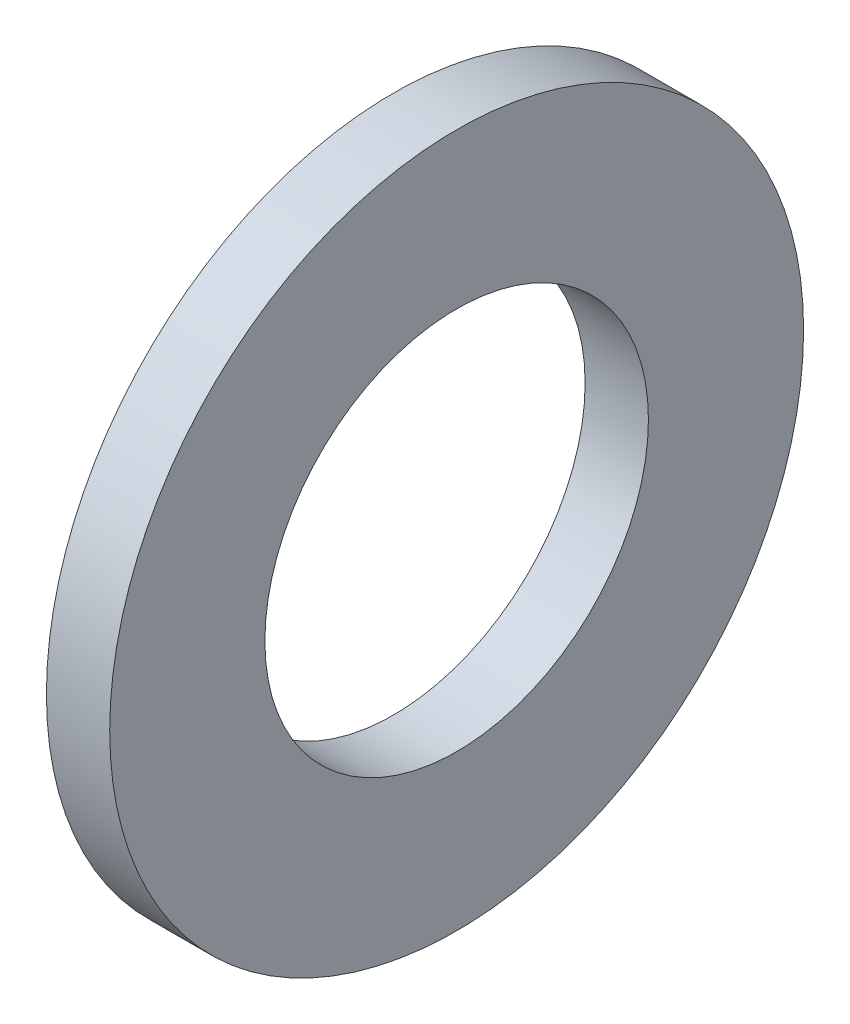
ISO-10303-21;
HEADER;
FILE_DESCRIPTION(('STEP AP214'),'2;1');
FILE_NAME('part.step','',(''),(''),'','','');
FILE_SCHEMA(('AUTOMOTIVE_DESIGN { 1 0 10303 214 1 1 1 1 }'));
ENDSEC;
DATA;
#1=APPLICATION_CONTEXT('core data for automotive mechanical design processes');
#2=APPLICATION_PROTOCOL_DEFINITION('international standard','automotive_design',2000,#1);
#3=PRODUCT_CONTEXT('',#1,'mechanical');
#4=PRODUCT('Part','Part','',(#3));
#5=PRODUCT_RELATED_PRODUCT_CATEGORY('part','',(#4));
#6=PRODUCT_DEFINITION_FORMATION('','',#4);
#7=PRODUCT_DEFINITION_CONTEXT('part definition',#1,'design');
#8=PRODUCT_DEFINITION('design','',#6,#7);
#9=PRODUCT_DEFINITION_SHAPE('','',#8);
#10=(LENGTH_UNIT() NAMED_UNIT(*) SI_UNIT(.MILLI.,.METRE.));
#11=(NAMED_UNIT(*) PLANE_ANGLE_UNIT() SI_UNIT($,.RADIAN.));
#12=(NAMED_UNIT(*) SI_UNIT($,.STERADIAN.) SOLID_ANGLE_UNIT());
#13=UNCERTAINTY_MEASURE_WITH_UNIT(LENGTH_MEASURE(1.E-05),#10,'distance_accuracy_value','');
#14=(GEOMETRIC_REPRESENTATION_CONTEXT(3) GLOBAL_UNCERTAINTY_ASSIGNED_CONTEXT((#13)) GLOBAL_UNIT_ASSIGNED_CONTEXT((#10,
#11,#12)) REPRESENTATION_CONTEXT('',''));
#15=CARTESIAN_POINT('',(0.,0.,0.));
#16=DIRECTION('',(0.,0.,1.));
#17=DIRECTION('',(1.,0.,0.));
#18=AXIS2_PLACEMENT_3D('',#15,#16,#17);
#19=CARTESIAN_POINT('',(-34.9249999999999,0.,0.));
#20=DIRECTION('',(-1.,0.,0.));
#21=DIRECTION('',(0.,0.,1.));
#22=AXIS2_PLACEMENT_3D('',#19,#20,#21);
#23=CYLINDRICAL_SURFACE('',#22,10.3124);
#24=CARTESIAN_POINT('',(0.,0.,0.));
#25=DIRECTION('',(-1.,0.,0.));
#26=DIRECTION('',(0.,0.,1.));
#27=AXIS2_PLACEMENT_3D('',#24,#25,#26);
#28=CIRCLE('',#27,10.3124);
#29=CARTESIAN_POINT('',(0.,0.,10.3124));
#30=VERTEX_POINT('',#29);
#31=EDGE_CURVE('E10',#30,#30,#28,.T.);
#32=ORIENTED_EDGE('',*,*,#31,.F.);
#33=EDGE_LOOP('',(#32));
#34=FACE_BOUND('',#33,.T.);
#35=CARTESIAN_POINT('',(-3.4036,0.,0.));
#36=DIRECTION('',(-1.,0.,0.));
#37=DIRECTION('',(0.,0.,1.));
#38=AXIS2_PLACEMENT_3D('',#35,#36,#37);
#39=CIRCLE('',#38,10.3124);
#40=CARTESIAN_POINT('',(-3.4036,0.,10.3124));
#41=VERTEX_POINT('',#40);
#42=EDGE_CURVE('E44',#41,#41,#39,.T.);
#43=ORIENTED_EDGE('',*,*,#42,.T.);
#44=EDGE_LOOP('',(#43));
#45=FACE_BOUND('',#44,.T.);
#46=ADVANCED_FACE('F30',(#34,#45),#23,.F.);
#47=CARTESIAN_POINT('',(0.,10.3124,0.));
#48=DIRECTION('',(-1.,0.,0.));
#49=DIRECTION('',(0.,0.,1.));
#50=AXIS2_PLACEMENT_3D('',#47,#48,#49);
#51=PLANE('',#50);
#52=CARTESIAN_POINT('',(0.,0.,0.));
#53=DIRECTION('',(-1.,0.,0.));
#54=DIRECTION('',(0.,0.,1.));
#55=AXIS2_PLACEMENT_3D('',#52,#53,#54);
#56=CIRCLE('',#55,18.6563);
#57=CARTESIAN_POINT('',(0.,0.,18.6563));
#58=VERTEX_POINT('',#57);
#59=EDGE_CURVE('E36',#58,#58,#56,.T.);
#60=ORIENTED_EDGE('',*,*,#59,.F.);
#61=EDGE_LOOP('',(#60));
#62=FACE_BOUND('',#61,.T.);
#63=ORIENTED_EDGE('',*,*,#31,.T.);
#64=EDGE_LOOP('',(#63));
#65=FACE_BOUND('',#64,.T.);
#66=ADVANCED_FACE('F59',(#62,#65),#51,.F.);
#67=CARTESIAN_POINT('',(-34.9249999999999,0.,0.));
#68=DIRECTION('',(-1.,0.,0.));
#69=DIRECTION('',(0.,0.,1.));
#70=AXIS2_PLACEMENT_3D('',#67,#68,#69);
#71=CYLINDRICAL_SURFACE('',#70,18.6563);
#72=CARTESIAN_POINT('',(-3.4036,0.,0.));
#73=DIRECTION('',(-1.,0.,0.));
#74=DIRECTION('',(0.,0.,1.));
#75=AXIS2_PLACEMENT_3D('',#72,#73,#74);
#76=CIRCLE('',#75,18.6563);
#77=CARTESIAN_POINT('',(-3.4036,0.,18.6563));
#78=VERTEX_POINT('',#77);
#79=EDGE_CURVE('E40',#78,#78,#76,.T.);
#80=ORIENTED_EDGE('',*,*,#79,.F.);
#81=EDGE_LOOP('',(#80));
#82=FACE_BOUND('',#81,.T.);
#83=ORIENTED_EDGE('',*,*,#59,.T.);
#84=EDGE_LOOP('',(#83));
#85=FACE_BOUND('',#84,.T.);
#86=ADVANCED_FACE('F54',(#82,#85),#71,.T.);
#87=CARTESIAN_POINT('',(-3.4036,18.6563,0.));
#88=DIRECTION('',(1.,0.,0.));
#89=DIRECTION('',(0.,0.,-1.));
#90=AXIS2_PLACEMENT_3D('',#87,#88,#89);
#91=PLANE('',#90);
#92=ORIENTED_EDGE('',*,*,#42,.F.);
#93=EDGE_LOOP('',(#92));
#94=FACE_BOUND('',#93,.T.);
#95=ORIENTED_EDGE('',*,*,#79,.T.);
#96=EDGE_LOOP('',(#95));
#97=FACE_BOUND('',#96,.T.);
#98=ADVANCED_FACE('F51',(#94,#97),#91,.F.);
#99=CLOSED_SHELL('',(#46,#66,#86,#98));
#100=MANIFOLD_SOLID_BREP('B2',#99);
#101=ADVANCED_BREP_SHAPE_REPRESENTATION('',(#18,#100),#14);
#102=SHAPE_DEFINITION_REPRESENTATION(#9,#101);
ENDSEC;
END-ISO-10303-21;
